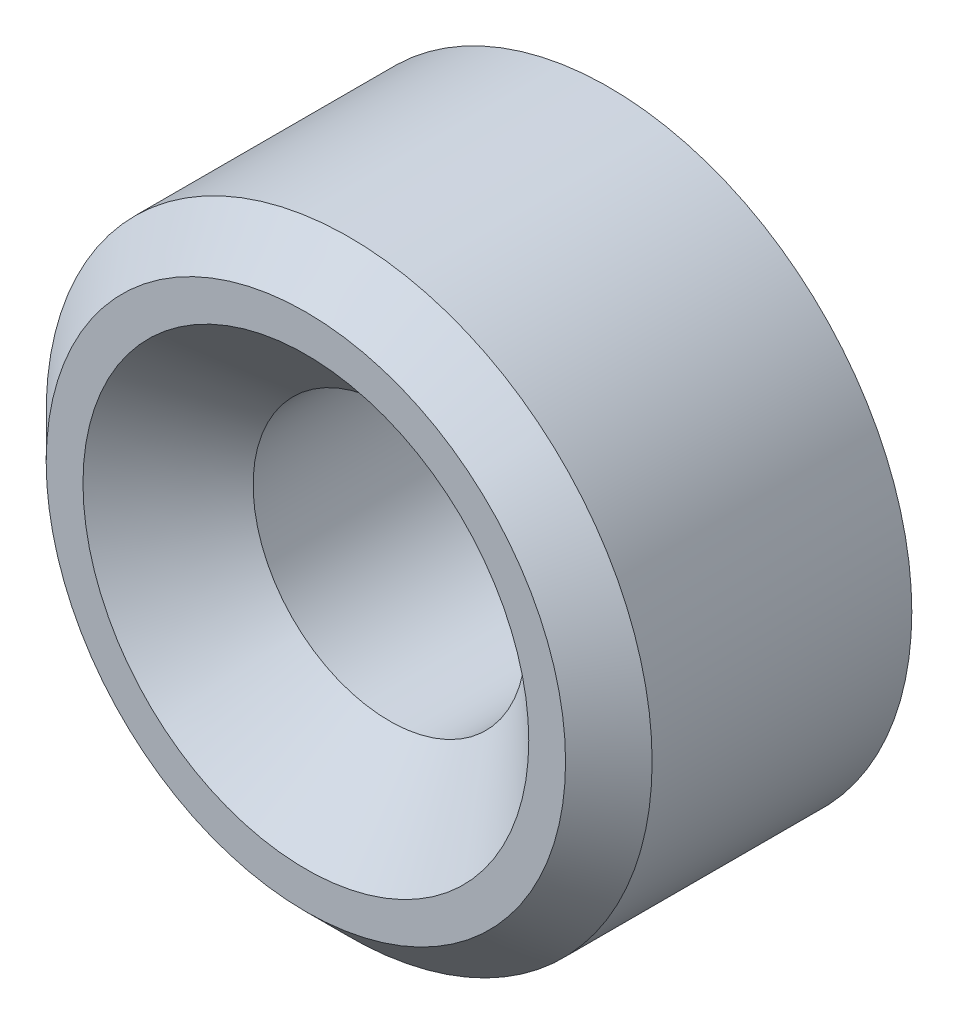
from build123d import *

# Parameters (mm, degrees)
ESQUISSE1_R          = 7
BASE_EXTRUSION_DEPTH = 7
CHANFREIN1_SIZE      = 1
PER_AGE2_D           = 6.3
PER_AGE2_CSINK_D     = 10.3
PER_AGE2_CSINK_ANGLE = 92


with BuildPart() as part:
    # Esquisse1 → Base-Extrusion (new body)
    with BuildSketch(Plane.XY):
        Circle(ESQUISSE1_R)
    extrude(amount=BASE_EXTRUSION_DEPTH)

    # Chanfrein1
    chanfrein1_edges = [part.edges().sort_by_distance(p)[0] for p in [
        (-7, 0, 7),
    ]]
    chamfer(chanfrein1_edges, length=CHANFREIN1_SIZE)

    # Per_age2 (through all)
    with Locations(Plane.XY.offset(7)):
        with Locations((0, 0)):
            CounterSinkHole(PER_AGE2_D / 2, PER_AGE2_CSINK_D / 2, counter_sink_angle=PER_AGE2_CSINK_ANGLE)


solid = part.part
